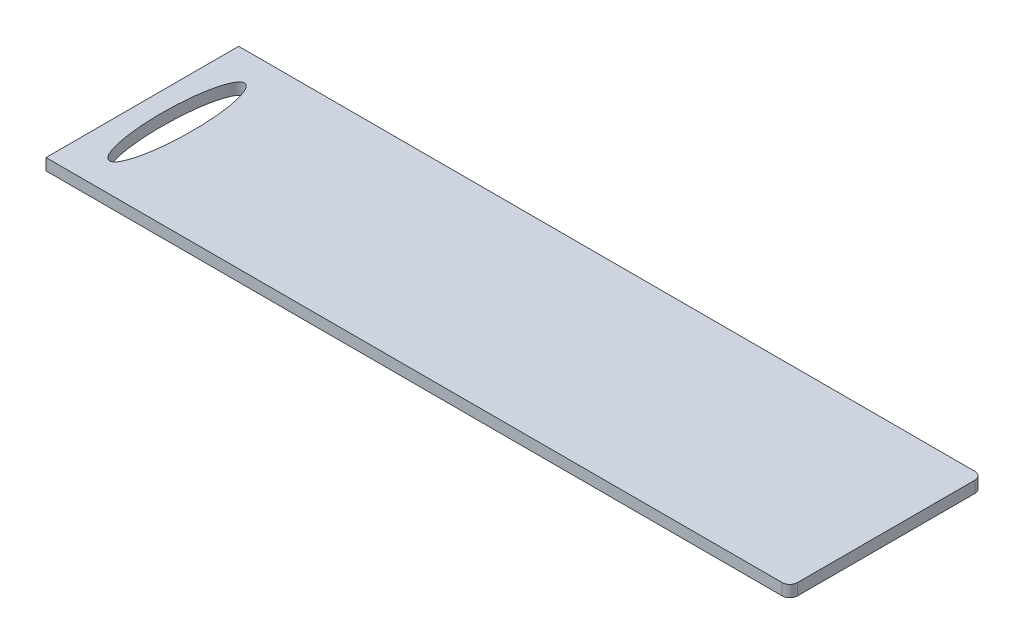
from build123d import *

# Parameters (mm, degrees)
SKETCH_1_RX     = 17.5
SKETCH_1_RY     = 4
EXTRUDE_1_DEPTH = 3


with BuildPart() as part:
    # Sketch 1 → Extrude 1 (new body)
    with BuildSketch(Plane(origin=(0, 0, 0), x_dir=(1, 0, 0), z_dir=(0, 1, 0))):
        with BuildLine():
            Line((-68.470891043, 14.439424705), (122.529108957, 14.439424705))
            ThreePointArc((122.529108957, 14.439424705), (123.943322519, 13.853638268), (124.529108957, 12.439424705))
            Line((124.529108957, 12.439424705), (124.529108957, -33.560575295))
            ThreePointArc((124.529108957, -33.560575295), (123.943322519, -34.974788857), (122.529108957, -35.560575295))
            Line((122.529108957, -35.560575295), (-68.470891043, -35.560575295))
            Line((-68.470891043, -35.560575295), (-68.470891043, 14.439424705))
        make_face()
        with Locations(Location((-59.470891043, -10.560575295), (0, 0, 90))):
            Ellipse(SKETCH_1_RX, SKETCH_1_RY, mode=Mode.SUBTRACT)
    extrude(amount=EXTRUDE_1_DEPTH)


solid = part.part
